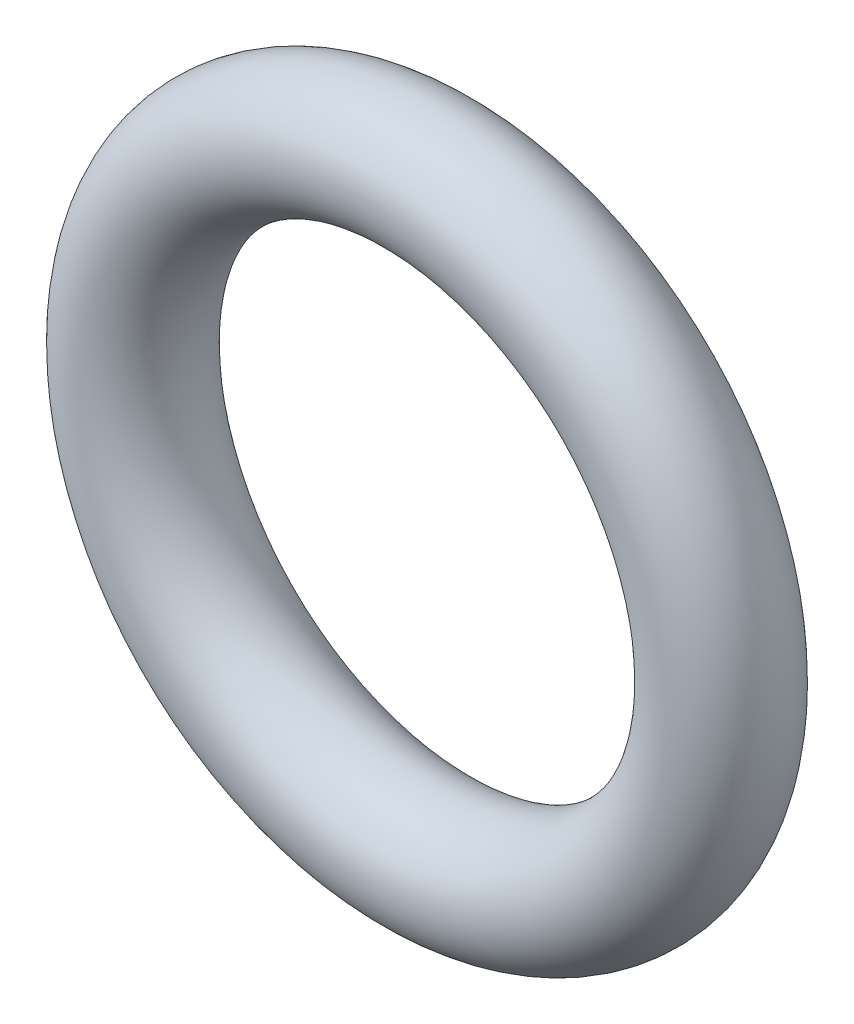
ISO-10303-21;
HEADER;
FILE_DESCRIPTION(('STEP AP214'),'2;1');
FILE_NAME('part.step','',(''),(''),'','','');
FILE_SCHEMA(('AUTOMOTIVE_DESIGN { 1 0 10303 214 1 1 1 1 }'));
ENDSEC;
DATA;
#1=APPLICATION_CONTEXT('core data for automotive mechanical design processes');
#2=APPLICATION_PROTOCOL_DEFINITION('international standard','automotive_design',2000,#1);
#3=PRODUCT_CONTEXT('',#1,'mechanical');
#4=PRODUCT('Part','Part','',(#3));
#5=PRODUCT_RELATED_PRODUCT_CATEGORY('part','',(#4));
#6=PRODUCT_DEFINITION_FORMATION('','',#4);
#7=PRODUCT_DEFINITION_CONTEXT('part definition',#1,'design');
#8=PRODUCT_DEFINITION('design','',#6,#7);
#9=PRODUCT_DEFINITION_SHAPE('','',#8);
#10=(LENGTH_UNIT() NAMED_UNIT(*) SI_UNIT(.MILLI.,.METRE.));
#11=(NAMED_UNIT(*) PLANE_ANGLE_UNIT() SI_UNIT($,.RADIAN.));
#12=(NAMED_UNIT(*) SI_UNIT($,.STERADIAN.) SOLID_ANGLE_UNIT());
#13=UNCERTAINTY_MEASURE_WITH_UNIT(LENGTH_MEASURE(1.E-05),#10,'distance_accuracy_value','');
#14=(GEOMETRIC_REPRESENTATION_CONTEXT(3) GLOBAL_UNCERTAINTY_ASSIGNED_CONTEXT((#13)) GLOBAL_UNIT_ASSIGNED_CONTEXT((#10,
#11,#12)) REPRESENTATION_CONTEXT('',''));
#15=CARTESIAN_POINT('',(0.,0.,0.));
#16=DIRECTION('',(0.,0.,1.));
#17=DIRECTION('',(1.,0.,0.));
#18=AXIS2_PLACEMENT_3D('',#15,#16,#17);
#19=CARTESIAN_POINT('',(0.,0.,0.));
#20=DIRECTION('',(0.,0.,-1.));
#21=DIRECTION('',(-1.,0.,0.));
#22=AXIS2_PLACEMENT_3D('',#19,#20,#21);
#23=TOROIDAL_SURFACE('',#22,3.85,0.8);
#24=CARTESIAN_POINT('',(-4.65,0.,0.));
#25=VERTEX_POINT('',#24);
#26=VERTEX_LOOP('',#25);
#27=FACE_BOUND('',#26,.T.);
#28=ADVANCED_FACE('F29',(#27),#23,.T.);
#29=CLOSED_SHELL('',(#28));
#30=MANIFOLD_SOLID_BREP('B2',#29);
#31=ADVANCED_BREP_SHAPE_REPRESENTATION('',(#18,#30),#14);
#32=SHAPE_DEFINITION_REPRESENTATION(#9,#31);
ENDSEC;
END-ISO-10303-21;
